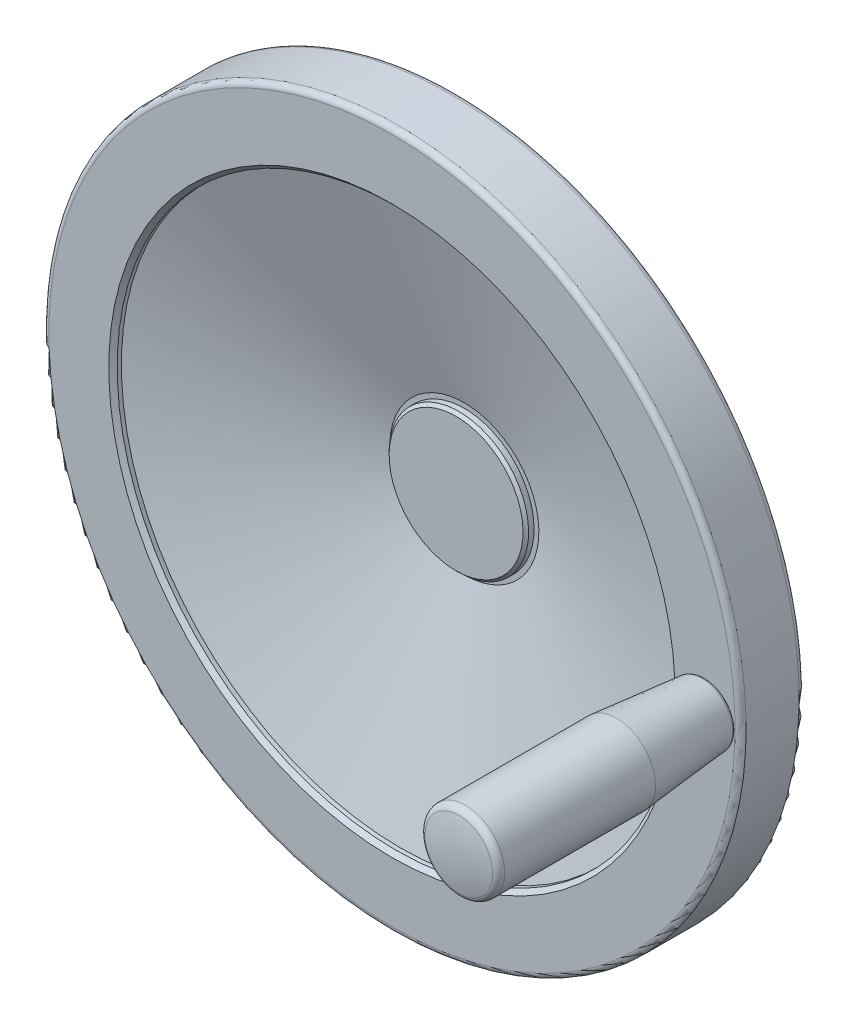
ISO-10303-21;
HEADER;
FILE_DESCRIPTION(('STEP AP214'),'2;1');
FILE_NAME('part.step','',(''),(''),'','','');
FILE_SCHEMA(('AUTOMOTIVE_DESIGN { 1 0 10303 214 1 1 1 1 }'));
ENDSEC;
DATA;
#1=APPLICATION_CONTEXT('core data for automotive mechanical design processes');
#2=APPLICATION_PROTOCOL_DEFINITION('international standard','automotive_design',2000,#1);
#3=PRODUCT_CONTEXT('',#1,'mechanical');
#4=PRODUCT('Part','Part','',(#3));
#5=PRODUCT_RELATED_PRODUCT_CATEGORY('part','',(#4));
#6=PRODUCT_DEFINITION_FORMATION('','',#4);
#7=PRODUCT_DEFINITION_CONTEXT('part definition',#1,'design');
#8=PRODUCT_DEFINITION('design','',#6,#7);
#9=PRODUCT_DEFINITION_SHAPE('','',#8);
#10=(LENGTH_UNIT() NAMED_UNIT(*) SI_UNIT(.MILLI.,.METRE.));
#11=(NAMED_UNIT(*) PLANE_ANGLE_UNIT() SI_UNIT($,.RADIAN.));
#12=(NAMED_UNIT(*) SI_UNIT($,.STERADIAN.) SOLID_ANGLE_UNIT());
#13=UNCERTAINTY_MEASURE_WITH_UNIT(LENGTH_MEASURE(1.E-05),#10,'distance_accuracy_value','');
#14=(GEOMETRIC_REPRESENTATION_CONTEXT(3) GLOBAL_UNCERTAINTY_ASSIGNED_CONTEXT((#13)) GLOBAL_UNIT_ASSIGNED_CONTEXT((#10,
#11,#12)) REPRESENTATION_CONTEXT('',''));
#15=CARTESIAN_POINT('',(0.,0.,0.));
#16=DIRECTION('',(0.,0.,1.));
#17=DIRECTION('',(1.,0.,0.));
#18=AXIS2_PLACEMENT_3D('',#15,#16,#17);
#19=CARTESIAN_POINT('',(0.,0.,17.));
#20=DIRECTION('',(0.,0.,-1.));
#21=DIRECTION('',(0.,1.,0.));
#22=AXIS2_PLACEMENT_3D('',#19,#20,#21);
#23=CONICAL_SURFACE('',#22,2.99999999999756,1.0471975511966);
#24=CARTESIAN_POINT('',(0.,0.,18.732050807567));
#25=VERTEX_POINT('',#24);
#26=VERTEX_LOOP('',#25);
#27=FACE_BOUND('',#26,.T.);
#28=CARTESIAN_POINT('',(0.,0.,17.));
#29=DIRECTION('',(0.,0.,1.));
#30=DIRECTION('',(0.,-1.,0.));
#31=AXIS2_PLACEMENT_3D('',#28,#29,#30);
#32=CIRCLE('',#31,2.99999999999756);
#33=CARTESIAN_POINT('',(0.,-2.99999999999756,17.));
#34=VERTEX_POINT('',#33);
#35=EDGE_CURVE('E9',#34,#34,#32,.T.);
#36=ORIENTED_EDGE('',*,*,#35,.F.);
#37=EDGE_LOOP('',(#36));
#38=FACE_BOUND('',#37,.T.);
#39=ADVANCED_FACE('F14',(#27,#38),#23,.F.);
#40=CARTESIAN_POINT('',(0.,0.,78.));
#41=DIRECTION('',(0.,0.,1.));
#42=DIRECTION('',(0.,-1.,0.));
#43=AXIS2_PLACEMENT_3D('',#40,#41,#42);
#44=CYLINDRICAL_SURFACE('',#43,2.99999999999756);
#45=ORIENTED_EDGE('',*,*,#35,.T.);
#46=EDGE_LOOP('',(#45));
#47=FACE_BOUND('',#46,.T.);
#48=CARTESIAN_POINT('',(0.,0.,0.));
#49=DIRECTION('',(0.,0.,1.));
#50=DIRECTION('',(0.,-1.,0.));
#51=AXIS2_PLACEMENT_3D('',#48,#49,#50);
#52=CIRCLE('',#51,2.99999999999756);
#53=CARTESIAN_POINT('',(0.,-2.99999999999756,0.));
#54=VERTEX_POINT('',#53);
#55=EDGE_CURVE('E20',#54,#54,#52,.T.);
#56=ORIENTED_EDGE('',*,*,#55,.F.);
#57=EDGE_LOOP('',(#56));
#58=FACE_BOUND('',#57,.T.);
#59=ADVANCED_FACE('F25',(#47,#58),#44,.F.);
#60=CARTESIAN_POINT('',(22.9999999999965,0.,0.));
#61=DIRECTION('',(0.,0.,-1.));
#62=DIRECTION('',(0.,1.,0.));
#63=AXIS2_PLACEMENT_3D('',#60,#61,#62);
#64=PLANE('',#63);
#65=ORIENTED_EDGE('',*,*,#55,.T.);
#66=EDGE_LOOP('',(#65));
#67=FACE_BOUND('',#66,.T.);
#68=CARTESIAN_POINT('',(0.,0.,0.));
#69=DIRECTION('',(0.,0.,1.));
#70=DIRECTION('',(0.,-1.,0.));
#71=AXIS2_PLACEMENT_3D('',#68,#69,#70);
#72=CIRCLE('',#71,22.9999999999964);
#73=CARTESIAN_POINT('',(0.,-22.9999999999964,0.));
#74=VERTEX_POINT('',#73);
#75=EDGE_CURVE('E34',#74,#74,#72,.T.);
#76=ORIENTED_EDGE('',*,*,#75,.F.);
#77=EDGE_LOOP('',(#76));
#78=FACE_BOUND('',#77,.T.);
#79=ADVANCED_FACE('F30',(#67,#78),#64,.T.);
#80=CARTESIAN_POINT('',(0.,0.,0.));
#81=DIRECTION('',(0.,0.,1.));
#82=DIRECTION('',(0.,-1.,0.));
#83=AXIS2_PLACEMENT_3D('',#80,#81,#82);
#84=CONICAL_SURFACE('',#83,22.9999999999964,0.78539816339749);
#85=CARTESIAN_POINT('',(0.,0.,2.));
#86=DIRECTION('',(0.,0.,1.));
#87=DIRECTION('',(0.,-1.,0.));
#88=AXIS2_PLACEMENT_3D('',#85,#86,#87);
#89=CIRCLE('',#88,24.9999999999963);
#90=CARTESIAN_POINT('',(0.,-24.9999999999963,2.));
#91=VERTEX_POINT('',#90);
#92=EDGE_CURVE('E36',#91,#91,#89,.T.);
#93=ORIENTED_EDGE('',*,*,#92,.F.);
#94=EDGE_LOOP('',(#93));
#95=FACE_BOUND('',#94,.T.);
#96=ORIENTED_EDGE('',*,*,#75,.T.);
#97=EDGE_LOOP('',(#96));
#98=FACE_BOUND('',#97,.T.);
#99=ADVANCED_FACE('F219',(#95,#98),#84,.T.);
#100=CARTESIAN_POINT('',(0.,0.,78.));
#101=DIRECTION('',(0.,0.,1.));
#102=DIRECTION('',(0.,-1.,0.));
#103=AXIS2_PLACEMENT_3D('',#100,#101,#102);
#104=CYLINDRICAL_SURFACE('',#103,24.9999999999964);
#105=ORIENTED_EDGE('',*,*,#92,.T.);
#106=EDGE_LOOP('',(#105));
#107=FACE_BOUND('',#106,.T.);
#108=CARTESIAN_POINT('',(0.,0.,23.6));
#109=DIRECTION('',(0.,0.,1.));
#110=DIRECTION('',(0.,-1.,0.));
#111=AXIS2_PLACEMENT_3D('',#108,#109,#110);
#112=CIRCLE('',#111,24.9999999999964);
#113=CARTESIAN_POINT('',(0.,-24.9999999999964,23.6));
#114=VERTEX_POINT('',#113);
#115=EDGE_CURVE('E41',#114,#114,#112,.T.);
#116=ORIENTED_EDGE('',*,*,#115,.F.);
#117=EDGE_LOOP('',(#116));
#118=FACE_BOUND('',#117,.T.);
#119=ADVANCED_FACE('F215',(#107,#118),#104,.T.);
#120=CARTESIAN_POINT('',(0.,0.,23.6));
#121=DIRECTION('',(0.,0.,1.));
#122=DIRECTION('',(0.,-1.,0.));
#123=AXIS2_PLACEMENT_3D('',#120,#121,#122);
#124=TOROIDAL_SURFACE('',#123,25.3999999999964,0.39999999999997);
#125=ORIENTED_EDGE('',*,*,#115,.T.);
#126=EDGE_LOOP('',(#125));
#127=FACE_BOUND('',#126,.T.);
#128=CARTESIAN_POINT('',(0.,0.,24.));
#129=DIRECTION('',(0.,0.,1.));
#130=DIRECTION('',(0.,-1.,0.));
#131=AXIS2_PLACEMENT_3D('',#128,#129,#130);
#132=CIRCLE('',#131,25.3999999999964);
#133=CARTESIAN_POINT('',(0.,-25.3999999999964,24.));
#134=VERTEX_POINT('',#133);
#135=EDGE_CURVE('E44',#134,#134,#132,.T.);
#136=ORIENTED_EDGE('',*,*,#135,.F.);
#137=EDGE_LOOP('',(#136));
#138=FACE_BOUND('',#137,.T.);
#139=ADVANCED_FACE('F211',(#127,#138),#124,.F.);
#140=CARTESIAN_POINT('',(25.3999999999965,0.,24.));
#141=DIRECTION('',(0.,0.,1.));
#142=DIRECTION('',(0.,-1.,0.));
#143=AXIS2_PLACEMENT_3D('',#140,#141,#142);
#144=PLANE('',#143);
#145=CARTESIAN_POINT('',(0.,0.,24.));
#146=DIRECTION('',(0.,0.,1.));
#147=DIRECTION('',(0.,-1.,0.));
#148=AXIS2_PLACEMENT_3D('',#145,#146,#147);
#149=CIRCLE('',#148,26.9999999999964);
#150=CARTESIAN_POINT('',(0.,-26.9999999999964,24.));
#151=VERTEX_POINT('',#150);
#152=EDGE_CURVE('E47',#151,#151,#149,.T.);
#153=ORIENTED_EDGE('',*,*,#152,.F.);
#154=EDGE_LOOP('',(#153));
#155=FACE_BOUND('',#154,.T.);
#156=ORIENTED_EDGE('',*,*,#135,.T.);
#157=EDGE_LOOP('',(#156));
#158=FACE_BOUND('',#157,.T.);
#159=ADVANCED_FACE('F207',(#155,#158),#144,.F.);
#160=CARTESIAN_POINT('',(0.,0.,78.));
#161=DIRECTION('',(0.,0.,1.));
#162=DIRECTION('',(0.,-1.,0.));
#163=AXIS2_PLACEMENT_3D('',#160,#161,#162);
#164=CYLINDRICAL_SURFACE('',#163,26.9999999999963);
#165=CARTESIAN_POINT('',(0.,0.,24.598901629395));
#166=DIRECTION('',(0.,0.,1.));
#167=DIRECTION('',(0.,-1.,0.));
#168=AXIS2_PLACEMENT_3D('',#165,#166,#167);
#169=CIRCLE('',#168,26.9999999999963);
#170=CARTESIAN_POINT('',(0.,-26.9999999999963,24.598901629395));
#171=VERTEX_POINT('',#170);
#172=EDGE_CURVE('E50',#171,#171,#169,.T.);
#173=ORIENTED_EDGE('',*,*,#172,.F.);
#174=EDGE_LOOP('',(#173));
#175=FACE_BOUND('',#174,.T.);
#176=ORIENTED_EDGE('',*,*,#152,.T.);
#177=EDGE_LOOP('',(#176));
#178=FACE_BOUND('',#177,.T.);
#179=ADVANCED_FACE('F203',(#175,#178),#164,.T.);
#180=CARTESIAN_POINT('',(0.,0.,24.598901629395));
#181=DIRECTION('',(0.,0.,1.));
#182=DIRECTION('',(0.,-1.,0.));
#183=AXIS2_PLACEMENT_3D('',#180,#181,#182);
#184=TOROIDAL_SURFACE('',#183,31.9999999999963,5.);
#185=ORIENTED_EDGE('',*,*,#172,.T.);
#186=EDGE_LOOP('',(#185));
#187=FACE_BOUND('',#186,.T.);
#188=CARTESIAN_POINT('',(0.,0.,29.3327653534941));
#189=DIRECTION('',(0.,0.,1.));
#190=DIRECTION('',(0.,-1.,0.));
#191=AXIS2_PLACEMENT_3D('',#188,#189,#190);
#192=CIRCLE('',#191,30.3904863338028);
#193=CARTESIAN_POINT('',(0.,-30.3904863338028,29.3327653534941));
#194=VERTEX_POINT('',#193);
#195=EDGE_CURVE('E53',#194,#194,#192,.T.);
#196=ORIENTED_EDGE('',*,*,#195,.F.);
#197=EDGE_LOOP('',(#196));
#198=FACE_BOUND('',#197,.T.);
#199=ADVANCED_FACE('F199',(#187,#198),#184,.F.);
#200=CARTESIAN_POINT('',(0.,0.,29.3327653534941));
#201=DIRECTION('',(0.,0.,1.));
#202=DIRECTION('',(0.,-1.,0.));
#203=AXIS2_PLACEMENT_3D('',#200,#201,#202);
#204=CONICAL_SURFACE('',#203,30.3904863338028,1.24305782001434);
#205=CARTESIAN_POINT('',(0.,0.,40.));
#206=DIRECTION('',(0.,0.,1.));
#207=DIRECTION('',(0.,-1.,0.));
#208=AXIS2_PLACEMENT_3D('',#205,#206,#207);
#209=CIRCLE('',#208,61.7647058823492);
#210=CARTESIAN_POINT('',(0.,-61.7647058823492,40.));
#211=VERTEX_POINT('',#210);
#212=EDGE_CURVE('E56',#211,#211,#209,.T.);
#213=ORIENTED_EDGE('',*,*,#212,.F.);
#214=EDGE_LOOP('',(#213));
#215=FACE_BOUND('',#214,.T.);
#216=ORIENTED_EDGE('',*,*,#195,.T.);
#217=EDGE_LOOP('',(#216));
#218=FACE_BOUND('',#217,.T.);
#219=ADVANCED_FACE('F195',(#215,#218),#204,.T.);
#220=CARTESIAN_POINT('',(122.999999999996,0.,40.));
#221=DIRECTION('',(0.,0.,-1.));
#222=DIRECTION('',(0.,1.,0.));
#223=AXIS2_PLACEMENT_3D('',#220,#221,#222);
#224=PLANE('',#223);
#225=ORIENTED_EDGE('',*,*,#212,.T.);
#226=EDGE_LOOP('',(#225));
#227=FACE_BOUND('',#226,.T.);
#228=CARTESIAN_POINT('',(0.,0.,40.));
#229=DIRECTION('',(0.,0.,1.));
#230=DIRECTION('',(0.,-1.,0.));
#231=AXIS2_PLACEMENT_3D('',#228,#229,#230);
#232=CIRCLE('',#231,122.999999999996);
#233=CARTESIAN_POINT('',(0.,-122.999999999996,40.));
#234=VERTEX_POINT('',#233);
#235=EDGE_CURVE('E59',#234,#234,#232,.T.);
#236=ORIENTED_EDGE('',*,*,#235,.F.);
#237=EDGE_LOOP('',(#236));
#238=FACE_BOUND('',#237,.T.);
#239=ADVANCED_FACE('F191',(#227,#238),#224,.T.);
#240=CARTESIAN_POINT('',(0.,0.,42.));
#241=DIRECTION('',(0.,0.,1.));
#242=DIRECTION('',(0.,-1.,0.));
#243=AXIS2_PLACEMENT_3D('',#240,#241,#242);
#244=TOROIDAL_SURFACE('',#243,122.999999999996,2.);
#245=CARTESIAN_POINT('',(0.,0.,42.));
#246=DIRECTION('',(0.,0.,1.));
#247=DIRECTION('',(0.,-1.,0.));
#248=AXIS2_PLACEMENT_3D('',#245,#246,#247);
#249=CIRCLE('',#248,124.999999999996);
#250=CARTESIAN_POINT('',(0.,-124.999999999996,42.));
#251=VERTEX_POINT('',#250);
#252=EDGE_CURVE('E62',#251,#251,#249,.T.);
#253=ORIENTED_EDGE('',*,*,#252,.F.);
#254=EDGE_LOOP('',(#253));
#255=FACE_BOUND('',#254,.T.);
#256=ORIENTED_EDGE('',*,*,#235,.T.);
#257=EDGE_LOOP('',(#256));
#258=FACE_BOUND('',#257,.T.);
#259=ADVANCED_FACE('F187',(#255,#258),#244,.T.);
#260=CARTESIAN_POINT('',(0.,0.,78.));
#261=DIRECTION('',(0.,0.,1.));
#262=DIRECTION('',(0.,-1.,0.));
#263=AXIS2_PLACEMENT_3D('',#260,#261,#262);
#264=CYLINDRICAL_SURFACE('',#263,124.999999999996);
#265=ORIENTED_EDGE('',*,*,#252,.T.);
#266=EDGE_LOOP('',(#265));
#267=FACE_BOUND('',#266,.T.);
#268=CARTESIAN_POINT('',(0.,0.,61.));
#269=DIRECTION('',(0.,0.,1.));
#270=DIRECTION('',(0.,-1.,0.));
#271=AXIS2_PLACEMENT_3D('',#268,#269,#270);
#272=CIRCLE('',#271,124.999999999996);
#273=CARTESIAN_POINT('',(0.,-124.999999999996,61.));
#274=VERTEX_POINT('',#273);
#275=EDGE_CURVE('E65',#274,#274,#272,.T.);
#276=ORIENTED_EDGE('',*,*,#275,.F.);
#277=EDGE_LOOP('',(#276));
#278=FACE_BOUND('',#277,.T.);
#279=ADVANCED_FACE('F183',(#267,#278),#264,.T.);
#280=CARTESIAN_POINT('',(0.,0.,61.));
#281=DIRECTION('',(0.,0.,1.));
#282=DIRECTION('',(0.,-1.,0.));
#283=AXIS2_PLACEMENT_3D('',#280,#281,#282);
#284=TOROIDAL_SURFACE('',#283,122.999999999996,2.);
#285=CARTESIAN_POINT('',(0.,0.,63.));
#286=DIRECTION('',(0.,0.,1.));
#287=DIRECTION('',(0.,-1.,0.));
#288=AXIS2_PLACEMENT_3D('',#285,#286,#287);
#289=CIRCLE('',#288,122.999999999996);
#290=CARTESIAN_POINT('',(0.,-122.999999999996,63.));
#291=VERTEX_POINT('',#290);
#292=EDGE_CURVE('E68',#291,#291,#289,.T.);
#293=ORIENTED_EDGE('',*,*,#292,.F.);
#294=EDGE_LOOP('',(#293));
#295=FACE_BOUND('',#294,.T.);
#296=ORIENTED_EDGE('',*,*,#275,.T.);
#297=EDGE_LOOP('',(#296));
#298=FACE_BOUND('',#297,.T.);
#299=ADVANCED_FACE('F179',(#295,#298),#284,.T.);
#300=CARTESIAN_POINT('',(122.999999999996,0.,63.));
#301=DIRECTION('',(0.,0.,-1.));
#302=DIRECTION('',(0.,1.,0.));
#303=AXIS2_PLACEMENT_3D('',#300,#301,#302);
#304=PLANE('',#303);
#305=CARTESIAN_POINT('',(112.5,0.,63.));
#306=DIRECTION('',(0.,0.,1.));
#307=DIRECTION('',(0.,-1.,0.));
#308=AXIS2_PLACEMENT_3D('',#305,#306,#307);
#309=CIRCLE('',#308,5.99999999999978);
#310=CARTESIAN_POINT('',(112.5,-5.99999999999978,63.));
#311=VERTEX_POINT('',#310);
#312=EDGE_CURVE('E92',#311,#311,#309,.T.);
#313=ORIENTED_EDGE('',*,*,#312,.F.);
#314=EDGE_LOOP('',(#313));
#315=FACE_BOUND('',#314,.T.);
#316=CARTESIAN_POINT('',(0.,0.,63.));
#317=DIRECTION('',(0.,0.,1.));
#318=DIRECTION('',(0.,-1.,0.));
#319=AXIS2_PLACEMENT_3D('',#316,#317,#318);
#320=CIRCLE('',#319,101.499999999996);
#321=CARTESIAN_POINT('',(0.,-101.499999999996,63.));
#322=VERTEX_POINT('',#321);
#323=EDGE_CURVE('E71',#322,#322,#320,.T.);
#324=ORIENTED_EDGE('',*,*,#323,.F.);
#325=EDGE_LOOP('',(#324));
#326=FACE_BOUND('',#325,.T.);
#327=ORIENTED_EDGE('',*,*,#292,.T.);
#328=EDGE_LOOP('',(#327));
#329=FACE_BOUND('',#328,.T.);
#330=ADVANCED_FACE('F175',(#315,#326,#329),#304,.F.);
#331=CARTESIAN_POINT('',(0.,0.,63.));
#332=DIRECTION('',(0.,0.,1.));
#333=DIRECTION('',(0.,-1.,0.));
#334=AXIS2_PLACEMENT_3D('',#331,#332,#333);
#335=CONICAL_SURFACE('',#334,101.499999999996,0.78539816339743);
#336=CARTESIAN_POINT('',(0.,0.,61.5));
#337=DIRECTION('',(0.,0.,1.));
#338=DIRECTION('',(0.,-1.,0.));
#339=AXIS2_PLACEMENT_3D('',#336,#337,#338);
#340=CIRCLE('',#339,99.9999999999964);
#341=CARTESIAN_POINT('',(0.,-99.9999999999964,61.5));
#342=VERTEX_POINT('',#341);
#343=EDGE_CURVE('E74',#342,#342,#340,.T.);
#344=ORIENTED_EDGE('',*,*,#343,.F.);
#345=EDGE_LOOP('',(#344));
#346=FACE_BOUND('',#345,.T.);
#347=ORIENTED_EDGE('',*,*,#323,.T.);
#348=EDGE_LOOP('',(#347));
#349=FACE_BOUND('',#348,.T.);
#350=ADVANCED_FACE('F171',(#346,#349),#335,.F.);
#351=CARTESIAN_POINT('',(0.,0.,78.));
#352=DIRECTION('',(0.,0.,1.));
#353=DIRECTION('',(0.,-1.,0.));
#354=AXIS2_PLACEMENT_3D('',#351,#352,#353);
#355=CYLINDRICAL_SURFACE('',#354,99.9999999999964);
#356=CARTESIAN_POINT('',(0.,0.,60.));
#357=DIRECTION('',(0.,0.,1.));
#358=DIRECTION('',(0.,-1.,0.));
#359=AXIS2_PLACEMENT_3D('',#356,#357,#358);
#360=CIRCLE('',#359,99.9999999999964);
#361=CARTESIAN_POINT('',(0.,-99.9999999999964,60.));
#362=VERTEX_POINT('',#361);
#363=EDGE_CURVE('E77',#362,#362,#360,.T.);
#364=ORIENTED_EDGE('',*,*,#363,.F.);
#365=EDGE_LOOP('',(#364));
#366=FACE_BOUND('',#365,.T.);
#367=ORIENTED_EDGE('',*,*,#343,.T.);
#368=EDGE_LOOP('',(#367));
#369=FACE_BOUND('',#368,.T.);
#370=ADVANCED_FACE('F167',(#366,#369),#355,.F.);
#371=CARTESIAN_POINT('',(0.,0.,60.));
#372=DIRECTION('',(0.,0.,1.));
#373=DIRECTION('',(0.,-1.,0.));
#374=AXIS2_PLACEMENT_3D('',#371,#372,#373);
#375=CONICAL_SURFACE('',#374,99.9999999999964,1.26715244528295);
#376=CARTESIAN_POINT('',(0.,0.,37.041909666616));
#377=DIRECTION('',(0.,0.,1.));
#378=DIRECTION('',(0.,-1.,0.));
#379=AXIS2_PLACEMENT_3D('',#376,#377,#378);
#380=CIRCLE('',#379,26.7294989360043);
#381=CARTESIAN_POINT('',(0.,-26.7294989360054,37.041909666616));
#382=VERTEX_POINT('',#381);
#383=EDGE_CURVE('E80',#382,#382,#380,.T.);
#384=CARTESIAN_POINT('',(0.,-26.7294989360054,37.041909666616));
#385=CARTESIAN_POINT('',(0.,-27.4927333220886,37.2810564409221));
#386=CARTESIAN_POINT('',(0.,-28.2559677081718,37.5202032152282));
#387=CARTESIAN_POINT('',(0.,-29.7824364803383,37.9984967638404));
#388=CARTESIAN_POINT('',(0.,-30.5456708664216,38.2376435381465));
#389=CARTESIAN_POINT('',(0.,-32.072139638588,38.7159370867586));
#390=CARTESIAN_POINT('',(0.,-32.8353740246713,38.9550838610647));
#391=CARTESIAN_POINT('',(0.,-34.3618427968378,39.4333774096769));
#392=CARTESIAN_POINT('',(0.,-35.125077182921,39.672524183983));
#393=CARTESIAN_POINT('',(0.,-36.6515459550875,40.1508177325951));
#394=CARTESIAN_POINT('',(0.,-37.4147803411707,40.3899645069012));
#395=CARTESIAN_POINT('',(0.,-38.9412491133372,40.8682580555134));
#396=CARTESIAN_POINT('',(0.,-39.7044834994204,41.1074048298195));
#397=CARTESIAN_POINT('',(0.,-41.2309522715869,41.5856983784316));
#398=CARTESIAN_POINT('',(0.,-41.9941866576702,41.8248451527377));
#399=CARTESIAN_POINT('',(0.,-43.5206554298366,42.3031387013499));
#400=CARTESIAN_POINT('',(0.,-44.2838898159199,42.542285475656));
#401=CARTESIAN_POINT('',(0.,-45.8103585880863,43.0205790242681));
#402=CARTESIAN_POINT('',(0.,-46.5735929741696,43.2597257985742));
#403=CARTESIAN_POINT('',(0.,-48.1000617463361,43.7380193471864));
#404=CARTESIAN_POINT('',(0.,-48.8632961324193,43.9771661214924));
#405=CARTESIAN_POINT('',(0.,-50.3897649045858,44.4554596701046));
#406=CARTESIAN_POINT('',(0.,-51.152999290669,44.6946064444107));
#407=CARTESIAN_POINT('',(0.,-52.6794680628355,45.1728999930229));
#408=CARTESIAN_POINT('',(0.,-53.4427024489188,45.4120467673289));
#409=CARTESIAN_POINT('',(0.,-54.9691712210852,45.8903403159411));
#410=CARTESIAN_POINT('',(0.,-55.7324056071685,46.1294870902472));
#411=CARTESIAN_POINT('',(0.,-57.258874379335,46.6077806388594));
#412=CARTESIAN_POINT('',(0.,-58.0221087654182,46.8469274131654));
#413=CARTESIAN_POINT('',(0.,-59.5485775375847,47.3252209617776));
#414=CARTESIAN_POINT('',(0.,-60.3118119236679,47.5643677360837));
#415=CARTESIAN_POINT('',(0.,-61.8382806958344,48.0426612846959));
#416=CARTESIAN_POINT('',(0.,-62.6015150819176,48.2818080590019));
#417=CARTESIAN_POINT('',(0.,-64.1279838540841,48.7601016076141));
#418=CARTESIAN_POINT('',(0.,-64.8912182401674,48.9992483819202));
#419=CARTESIAN_POINT('',(0.,-66.4176870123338,49.4775419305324));
#420=CARTESIAN_POINT('',(0.,-67.1809213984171,49.7166887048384));
#421=CARTESIAN_POINT('',(0.,-68.7073901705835,50.1949822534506));
#422=CARTESIAN_POINT('',(0.,-69.4706245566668,50.4341290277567));
#423=CARTESIAN_POINT('',(0.,-70.9970933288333,50.9124225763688));
#424=CARTESIAN_POINT('',(0.,-71.7603277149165,51.1515693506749));
#425=CARTESIAN_POINT('',(0.,-73.286796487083,51.6298628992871));
#426=CARTESIAN_POINT('',(0.,-74.0500308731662,51.8690096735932));
#427=CARTESIAN_POINT('',(0.,-75.5764996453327,52.3473032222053));
#428=CARTESIAN_POINT('',(0.,-76.3397340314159,52.5864499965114));
#429=CARTESIAN_POINT('',(0.,-77.8662028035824,53.0647435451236));
#430=CARTESIAN_POINT('',(0.,-78.6294371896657,53.3038903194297));
#431=CARTESIAN_POINT('',(0.,-80.1559059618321,53.7821838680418));
#432=CARTESIAN_POINT('',(0.,-80.9191403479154,54.0213306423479));
#433=CARTESIAN_POINT('',(0.,-82.4456091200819,54.4996241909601));
#434=CARTESIAN_POINT('',(0.,-83.2088435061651,54.7387709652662));
#435=CARTESIAN_POINT('',(0.,-84.7353122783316,55.2170645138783));
#436=CARTESIAN_POINT('',(0.,-85.4985466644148,55.4562112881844));
#437=CARTESIAN_POINT('',(0.,-87.0250154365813,55.9345048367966));
#438=CARTESIAN_POINT('',(0.,-87.7882498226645,56.1736516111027));
#439=CARTESIAN_POINT('',(0.,-89.314718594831,56.6519451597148));
#440=CARTESIAN_POINT('',(0.,-90.0779529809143,56.8910919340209));
#441=CARTESIAN_POINT('',(0.,-91.6044217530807,57.3693854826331));
#442=CARTESIAN_POINT('',(0.,-92.367656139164,57.6085322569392));
#443=CARTESIAN_POINT('',(0.,-93.8941249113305,58.0868258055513));
#444=CARTESIAN_POINT('',(0.,-94.6573592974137,58.3259725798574));
#445=CARTESIAN_POINT('',(0.,-96.1838280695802,58.8042661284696));
#446=CARTESIAN_POINT('',(0.,-96.9470624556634,59.0434129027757));
#447=CARTESIAN_POINT('',(0.,-98.4735312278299,59.5217064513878));
#448=CARTESIAN_POINT('',(0.,-99.2367656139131,59.7608532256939));
#449=CARTESIAN_POINT('',(0.,-99.9999999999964,60.));
#450=B_SPLINE_CURVE_WITH_KNOTS('',3,(#384,#385,#386,#387,#388,#389,#390,#391,#392,#393,#394,
#395,#396,#397,#398,#399,#400,#401,#402,#403,#404,#405,#406,#407,#408,#409,#410,#411,#412,#413,
#414,#415,#416,#417,#418,#419,#420,#421,#422,#423,#424,#425,#426,#427,#428,#429,#430,#431,#432,
#433,#434,#435,#436,#437,#438,#439,#440,#441,#442,#443,#444,#445,#446,#447,#448,#449),
.UNSPECIFIED.,.F.,.F.,(4,2,2,2,2,2,2,2,2,2,2,2,2,2,2,2,2,2,2,2,2,2,2,2,2,2,2,2,2,2,2,2,4),(0.,
2.39947101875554,4.79894203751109,7.19841305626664,9.59788407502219,11.9973550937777,
14.3968261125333,16.7962971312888,19.1957681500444,21.5952391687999,23.9947101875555,
26.394181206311,28.7936522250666,31.1931232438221,33.5925942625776,35.9920652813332,
38.3915363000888,40.7910073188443,43.1904783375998,45.5899493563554,47.9894203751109,
50.3888913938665,52.788362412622,55.1878334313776,57.5873044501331,59.9867754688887,
62.3862464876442,64.7857175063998,67.1851885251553,69.5846595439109,71.9841305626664,
74.383601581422,76.7830726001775),.UNSPECIFIED.);
#451=EDGE_CURVE('BSEAM163',#382,#362,#450,.T.);
#452=ORIENTED_EDGE('',*,*,#383,.F.);
#453=ORIENTED_EDGE('',*,*,#363,.T.);
#454=ORIENTED_EDGE('',*,*,#451,.T.);
#455=ORIENTED_EDGE('',*,*,#451,.F.);
#456=EDGE_LOOP('',(#452,#454,#453,#455));
#457=FACE_BOUND('',#456,.T.);
#458=ADVANCED_FACE('F163',(#457),#375,.F.);
#459=CARTESIAN_POINT('',(26.7294989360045,0.,37.041909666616));
#460=DIRECTION('',(0.,0.,-1.));
#461=DIRECTION('',(0.,1.,0.));
#462=AXIS2_PLACEMENT_3D('',#459,#460,#461);
#463=PLANE('',#462);
#464=CARTESIAN_POINT('',(0.,0.,37.041909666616));
#465=DIRECTION('',(0.,0.,1.));
#466=DIRECTION('',(0.,-1.,0.));
#467=AXIS2_PLACEMENT_3D('',#464,#465,#466);
#468=CIRCLE('',#467,24.9999999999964);
#469=CARTESIAN_POINT('',(0.,-24.9999999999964,37.041909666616));
#470=VERTEX_POINT('',#469);
#471=EDGE_CURVE('E83',#470,#470,#468,.T.);
#472=ORIENTED_EDGE('',*,*,#471,.F.);
#473=EDGE_LOOP('',(#472));
#474=FACE_BOUND('',#473,.T.);
#475=ORIENTED_EDGE('',*,*,#383,.T.);
#476=EDGE_LOOP('',(#475));
#477=FACE_BOUND('',#476,.T.);
#478=ADVANCED_FACE('F159',(#474,#477),#463,.F.);
#479=CARTESIAN_POINT('',(0.,0.,78.));
#480=DIRECTION('',(0.,0.,1.));
#481=DIRECTION('',(0.,-1.,0.));
#482=AXIS2_PLACEMENT_3D('',#479,#480,#481);
#483=CYLINDRICAL_SURFACE('',#482,24.9999999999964);
#484=CARTESIAN_POINT('',(0.,0.,39.));
#485=DIRECTION('',(0.,0.,1.));
#486=DIRECTION('',(0.,-1.,0.));
#487=AXIS2_PLACEMENT_3D('',#484,#485,#486);
#488=CIRCLE('',#487,24.9999999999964);
#489=CARTESIAN_POINT('',(0.,-24.9999999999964,39.));
#490=VERTEX_POINT('',#489);
#491=EDGE_CURVE('E86',#490,#490,#488,.T.);
#492=ORIENTED_EDGE('',*,*,#491,.F.);
#493=EDGE_LOOP('',(#492));
#494=FACE_BOUND('',#493,.T.);
#495=ORIENTED_EDGE('',*,*,#471,.T.);
#496=EDGE_LOOP('',(#495));
#497=FACE_BOUND('',#496,.T.);
#498=ADVANCED_FACE('F155',(#494,#497),#483,.T.);
#499=CARTESIAN_POINT('',(0.,0.,40.));
#500=DIRECTION('',(0.,0.,-1.));
#501=DIRECTION('',(0.,1.,0.));
#502=AXIS2_PLACEMENT_3D('',#499,#500,#501);
#503=CONICAL_SURFACE('',#502,23.9999999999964,0.785398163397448);
#504=ORIENTED_EDGE('',*,*,#491,.T.);
#505=EDGE_LOOP('',(#504));
#506=FACE_BOUND('',#505,.T.);
#507=CARTESIAN_POINT('',(0.,0.,40.));
#508=DIRECTION('',(0.,0.,1.));
#509=DIRECTION('',(0.,-1.,0.));
#510=AXIS2_PLACEMENT_3D('',#507,#508,#509);
#511=CIRCLE('',#510,23.9999999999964);
#512=CARTESIAN_POINT('',(0.,-23.9999999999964,40.));
#513=VERTEX_POINT('',#512);
#514=EDGE_CURVE('E89',#513,#513,#511,.T.);
#515=ORIENTED_EDGE('',*,*,#514,.F.);
#516=EDGE_LOOP('',(#515));
#517=FACE_BOUND('',#516,.T.);
#518=ADVANCED_FACE('F151',(#506,#517),#503,.T.);
#519=CARTESIAN_POINT('',(23.9999999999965,0.,40.));
#520=DIRECTION('',(0.,0.,-1.));
#521=DIRECTION('',(0.,1.,0.));
#522=AXIS2_PLACEMENT_3D('',#519,#520,#521);
#523=PLANE('',#522);
#524=ORIENTED_EDGE('',*,*,#514,.T.);
#525=EDGE_LOOP('',(#524));
#526=FACE_BOUND('',#525,.T.);
#527=ADVANCED_FACE('F147',(#526),#523,.F.);
#528=CARTESIAN_POINT('',(112.5,0.,168.));
#529=DIRECTION('',(0.,0.,1.));
#530=DIRECTION('',(0.,-1.,0.));
#531=AXIS2_PLACEMENT_3D('',#528,#529,#530);
#532=CYLINDRICAL_SURFACE('',#531,5.99999999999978);
#533=ORIENTED_EDGE('',*,*,#312,.T.);
#534=EDGE_LOOP('',(#533));
#535=FACE_BOUND('',#534,.T.);
#536=CARTESIAN_POINT('',(112.5,0.,63.3));
#537=DIRECTION('',(0.,0.,1.));
#538=DIRECTION('',(0.,-1.,0.));
#539=AXIS2_PLACEMENT_3D('',#536,#537,#538);
#540=CIRCLE('',#539,5.99999999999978);
#541=CARTESIAN_POINT('',(112.5,-5.99999999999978,63.3));
#542=VERTEX_POINT('',#541);
#543=EDGE_CURVE('E95',#542,#542,#540,.T.);
#544=ORIENTED_EDGE('',*,*,#543,.F.);
#545=EDGE_LOOP('',(#544));
#546=FACE_BOUND('',#545,.T.);
#547=ADVANCED_FACE('F143',(#535,#546),#532,.T.);
#548=CARTESIAN_POINT('',(122.362711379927,0.,63.3));
#549=DIRECTION('',(0.,0.,-1.));
#550=DIRECTION('',(0.,1.,0.));
#551=AXIS2_PLACEMENT_3D('',#548,#549,#550);
#552=PLANE('',#551);
#553=ORIENTED_EDGE('',*,*,#543,.T.);
#554=EDGE_LOOP('',(#553));
#555=FACE_BOUND('',#554,.T.);
#556=CARTESIAN_POINT('',(112.5,0.,63.3));
#557=DIRECTION('',(0.,0.,1.));
#558=DIRECTION('',(0.,-1.,0.));
#559=AXIS2_PLACEMENT_3D('',#556,#557,#558);
#560=CIRCLE('',#559,9.86271137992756);
#561=CARTESIAN_POINT('',(112.5,-9.86271137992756,63.3));
#562=VERTEX_POINT('',#561);
#563=EDGE_CURVE('E98',#562,#562,#560,.T.);
#564=ORIENTED_EDGE('',*,*,#563,.F.);
#565=EDGE_LOOP('',(#564));
#566=FACE_BOUND('',#565,.T.);
#567=ADVANCED_FACE('F139',(#555,#566),#552,.T.);
#568=CARTESIAN_POINT('',(112.5,0.,64.55));
#569=DIRECTION('',(0.,0.,1.));
#570=DIRECTION('',(0.,-1.,0.));
#571=AXIS2_PLACEMENT_3D('',#568,#569,#570);
#572=TOROIDAL_SURFACE('',#571,9.86271137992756,1.25000000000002);
#573=CARTESIAN_POINT('',(112.5,0.,64.4322296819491));
#574=DIRECTION('',(0.,0.,1.));
#575=DIRECTION('',(0.,-1.,0.));
#576=AXIS2_PLACEMENT_3D('',#573,#574,#575);
#577=CIRCLE('',#576,11.1071510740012);
#578=CARTESIAN_POINT('',(112.5,-11.1071510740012,64.4322296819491));
#579=VERTEX_POINT('',#578);
#580=EDGE_CURVE('E101',#579,#579,#577,.T.);
#581=ORIENTED_EDGE('',*,*,#580,.F.);
#582=EDGE_LOOP('',(#581));
#583=FACE_BOUND('',#582,.T.);
#584=ORIENTED_EDGE('',*,*,#563,.T.);
#585=EDGE_LOOP('',(#584));
#586=FACE_BOUND('',#585,.T.);
#587=ADVANCED_FACE('F132',(#583,#586),#572,.T.);
#588=CARTESIAN_POINT('',(112.5,0.,64.4322296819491));
#589=DIRECTION('',(0.,0.,1.));
#590=DIRECTION('',(0.,-1.,0.));
#591=AXIS2_PLACEMENT_3D('',#588,#589,#590);
#592=CONICAL_SURFACE('',#591,11.1071510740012,0.094356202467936);
#593=CARTESIAN_POINT('',(112.5,0.,95.));
#594=DIRECTION('',(0.,0.,1.));
#595=DIRECTION('',(0.,-1.,0.));
#596=AXIS2_PLACEMENT_3D('',#593,#594,#595);
#597=CIRCLE('',#596,13.9999999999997);
#598=CARTESIAN_POINT('',(112.5,-13.9999999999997,95.));
#599=VERTEX_POINT('',#598);
#600=EDGE_CURVE('E104',#599,#599,#597,.T.);
#601=ORIENTED_EDGE('',*,*,#600,.F.);
#602=EDGE_LOOP('',(#601));
#603=FACE_BOUND('',#602,.T.);
#604=ORIENTED_EDGE('',*,*,#580,.T.);
#605=EDGE_LOOP('',(#604));
#606=FACE_BOUND('',#605,.T.);
#607=ADVANCED_FACE('F124',(#603,#606),#592,.T.);
#608=CARTESIAN_POINT('',(112.5,0.,168.));
#609=DIRECTION('',(0.,0.,1.));
#610=DIRECTION('',(0.,-1.,0.));
#611=AXIS2_PLACEMENT_3D('',#608,#609,#610);
#612=CYLINDRICAL_SURFACE('',#611,13.9999999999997);
#613=ORIENTED_EDGE('',*,*,#600,.T.);
#614=EDGE_LOOP('',(#613));
#615=FACE_BOUND('',#614,.T.);
#616=CARTESIAN_POINT('',(112.5,0.,149.086874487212));
#617=DIRECTION('',(0.,0.,1.));
#618=DIRECTION('',(0.,-1.,0.));
#619=AXIS2_PLACEMENT_3D('',#616,#617,#618);
#620=CIRCLE('',#619,13.9999999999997);
#621=CARTESIAN_POINT('',(112.5,-13.9999999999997,149.086874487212));
#622=VERTEX_POINT('',#621);
#623=EDGE_CURVE('E107',#622,#622,#620,.T.);
#624=ORIENTED_EDGE('',*,*,#623,.F.);
#625=EDGE_LOOP('',(#624));
#626=FACE_BOUND('',#625,.T.);
#627=ADVANCED_FACE('F119',(#615,#626),#612,.T.);
#628=CARTESIAN_POINT('',(112.5,0.,149.086874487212));
#629=DIRECTION('',(0.,0.,1.));
#630=DIRECTION('',(0.,-1.,0.));
#631=AXIS2_PLACEMENT_3D('',#628,#629,#630);
#632=TOROIDAL_SURFACE('',#631,11.5000000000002,2.4999999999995);
#633=CARTESIAN_POINT('',(112.5,0.,151.512499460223));
#634=DIRECTION('',(0.,0.,1.));
#635=DIRECTION('',(0.,-1.,0.));
#636=AXIS2_PLACEMENT_3D('',#633,#634,#635);
#637=CIRCLE('',#636,12.1052631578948);
#638=CARTESIAN_POINT('',(112.5,-12.1052631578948,151.512499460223));
#639=VERTEX_POINT('',#638);
#640=EDGE_CURVE('E110',#639,#639,#637,.T.);
#641=ORIENTED_EDGE('',*,*,#640,.F.);
#642=EDGE_LOOP('',(#641));
#643=FACE_BOUND('',#642,.T.);
#644=ORIENTED_EDGE('',*,*,#623,.T.);
#645=EDGE_LOOP('',(#644));
#646=FACE_BOUND('',#645,.T.);
#647=ADVANCED_FACE('F116',(#643,#646),#632,.T.);
#648=CARTESIAN_POINT('',(112.5,0.,103.));
#649=DIRECTION('',(0.,-1.,0.));
#650=DIRECTION('',(0.,0.,-1.));
#651=AXIS2_PLACEMENT_3D('',#648,#649,#650);
#652=SPHERICAL_SURFACE('',#651,50.);
#653=CARTESIAN_POINT('',(112.5,0.,103.));
#654=DIRECTION('',(0.,0.,1.));
#655=DIRECTION('',(0.,-1.,0.));
#656=AXIS2_PLACEMENT_3D('',#653,#654,#655);
#657=SPHERICAL_SURFACE('',#656,50.);
#658=ORIENTED_EDGE('',*,*,#640,.T.);
#659=EDGE_LOOP('',(#658));
#660=FACE_BOUND('',#659,.T.);
#661=ADVANCED_FACE('F114',(#660),#657,.T.);
#662=CLOSED_SHELL('',(#39,#59,#79,#99,#119,#139,#159,#179,#199,#219,#239,#259,#279,#299,#330,
#350,#370,#458,#478,#498,#518,#527,#547,#567,#587,#607,#627,#647,#661));
#663=MANIFOLD_SOLID_BREP('B1',#662);
#664=ADVANCED_BREP_SHAPE_REPRESENTATION('',(#18,#663),#14);
#665=SHAPE_DEFINITION_REPRESENTATION(#9,#664);
ENDSEC;
END-ISO-10303-21;
